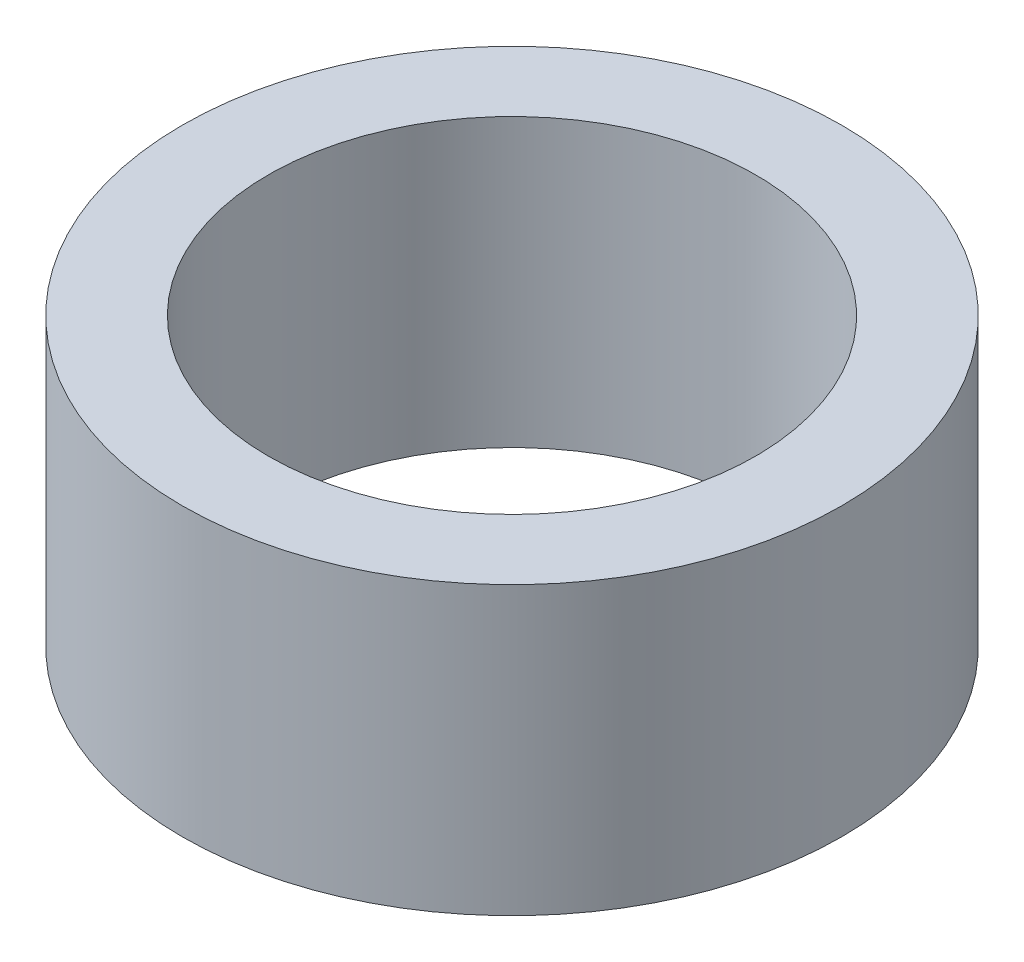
from build123d import *

# Parameters (mm, degrees)
CROQUIS1_R              = 5.75
CROQUIS1_R_2            = 4.25
SALIENTE_EXTRUIR1_DEPTH = 5


with BuildPart() as part:
    # Croquis1 → Saliente-Extruir1 (new body)
    with BuildSketch(Plane(origin=(0, 0, 0), x_dir=(1, 0, 0), z_dir=(0, 1, 0))):
        with Locations(Location((0, 0, 0), (0, 0, 270))):
            Circle(CROQUIS1_R)
        with Locations(Location((0, 0, 0), (0, 0, 270))):
            Circle(CROQUIS1_R_2, mode=Mode.SUBTRACT)
    extrude(amount=SALIENTE_EXTRUIR1_DEPTH)


solid = part.part
